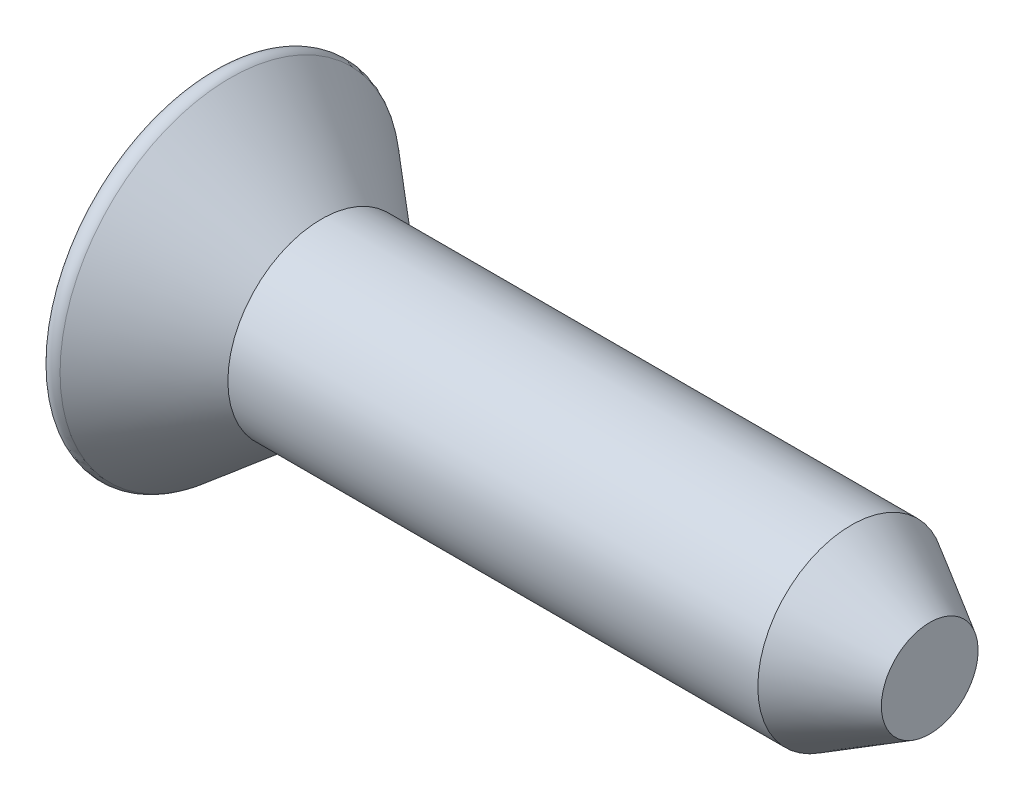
ISO-10303-21;
HEADER;
FILE_DESCRIPTION(('STEP AP214'),'2;1');
FILE_NAME('part.step','',(''),(''),'','','');
FILE_SCHEMA(('AUTOMOTIVE_DESIGN { 1 0 10303 214 1 1 1 1 }'));
ENDSEC;
DATA;
#1=APPLICATION_CONTEXT('core data for automotive mechanical design processes');
#2=APPLICATION_PROTOCOL_DEFINITION('international standard','automotive_design',2000,#1);
#3=PRODUCT_CONTEXT('',#1,'mechanical');
#4=PRODUCT('Part','Part','',(#3));
#5=PRODUCT_RELATED_PRODUCT_CATEGORY('part','',(#4));
#6=PRODUCT_DEFINITION_FORMATION('','',#4);
#7=PRODUCT_DEFINITION_CONTEXT('part definition',#1,'design');
#8=PRODUCT_DEFINITION('design','',#6,#7);
#9=PRODUCT_DEFINITION_SHAPE('','',#8);
#10=(LENGTH_UNIT() NAMED_UNIT(*) SI_UNIT(.MILLI.,.METRE.));
#11=(NAMED_UNIT(*) PLANE_ANGLE_UNIT() SI_UNIT($,.RADIAN.));
#12=(NAMED_UNIT(*) SI_UNIT($,.STERADIAN.) SOLID_ANGLE_UNIT());
#13=UNCERTAINTY_MEASURE_WITH_UNIT(LENGTH_MEASURE(1.E-05),#10,'distance_accuracy_value','');
#14=(GEOMETRIC_REPRESENTATION_CONTEXT(3) GLOBAL_UNCERTAINTY_ASSIGNED_CONTEXT((#13)) GLOBAL_UNIT_ASSIGNED_CONTEXT((#10,
#11,#12)) REPRESENTATION_CONTEXT('',''));
#15=CARTESIAN_POINT('',(0.,0.,0.));
#16=DIRECTION('',(0.,0.,1.));
#17=DIRECTION('',(1.,0.,0.));
#18=AXIS2_PLACEMENT_3D('',#15,#16,#17);
#19=CARTESIAN_POINT('',(0.,0.,0.));
#20=DIRECTION('',(-1.,0.,0.));
#21=DIRECTION('',(0.,0.,1.));
#22=AXIS2_PLACEMENT_3D('',#19,#20,#21);
#23=CYLINDRICAL_SURFACE('',#22,0.762);
#24=CARTESIAN_POINT('',(0.889,0.,0.));
#25=DIRECTION('',(-1.,0.,0.));
#26=DIRECTION('',(0.,0.,1.));
#27=AXIS2_PLACEMENT_3D('',#24,#25,#26);
#28=CIRCLE('',#27,0.762);
#29=CARTESIAN_POINT('',(0.889,0.,0.762));
#30=VERTEX_POINT('',#29);
#31=EDGE_CURVE('E234',#30,#30,#28,.T.);
#32=ORIENTED_EDGE('',*,*,#31,.F.);
#33=EDGE_LOOP('',(#32));
#34=FACE_BOUND('',#33,.T.);
#35=CARTESIAN_POINT('',(5.20408568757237,0.,0.));
#36=DIRECTION('',(-1.,0.,0.));
#37=DIRECTION('',(0.,0.,1.));
#38=AXIS2_PLACEMENT_3D('',#35,#36,#37);
#39=CIRCLE('',#38,0.762);
#40=CARTESIAN_POINT('',(5.20408568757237,0.,0.762));
#41=VERTEX_POINT('',#40);
#42=EDGE_CURVE('E453',#41,#41,#39,.T.);
#43=ORIENTED_EDGE('',*,*,#42,.T.);
#44=EDGE_LOOP('',(#43));
#45=FACE_BOUND('',#44,.T.);
#46=ADVANCED_FACE('F76',(#34,#45),#23,.T.);
#47=CARTESIAN_POINT('',(0.889,0.,0.));
#48=DIRECTION('',(-1.,0.,0.));
#49=DIRECTION('',(0.,0.,1.));
#50=AXIS2_PLACEMENT_3D('',#47,#48,#49);
#51=CONICAL_SURFACE('',#50,0.762,0.698131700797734);
#52=ORIENTED_EDGE('',*,*,#31,.T.);
#53=EDGE_LOOP('',(#52));
#54=FACE_BOUND('',#53,.T.);
#55=CARTESIAN_POINT('',(0.146043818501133,0.,0.));
#56=DIRECTION('',(-1.,0.,0.));
#57=DIRECTION('',(0.,0.,1.));
#58=AXIS2_PLACEMENT_3D('',#55,#56,#57);
#59=CIRCLE('',#58,1.38541425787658);
#60=CARTESIAN_POINT('',(0.146043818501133,0.,1.38541425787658));
#61=VERTEX_POINT('',#60);
#62=EDGE_CURVE('E237',#61,#61,#59,.T.);
#63=ORIENTED_EDGE('',*,*,#62,.F.);
#64=EDGE_LOOP('',(#63));
#65=FACE_BOUND('',#64,.T.);
#66=ADVANCED_FACE('F379',(#54,#65),#51,.T.);
#67=CARTESIAN_POINT('',(0.,0.1778,-0.7874));
#68=DIRECTION('',(-0.342020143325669,0.,0.939692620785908));
#69=DIRECTION('',(0.939692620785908,0.,0.342020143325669));
#70=AXIS2_PLACEMENT_3D('',#67,#68,#69);
#71=PLANE('',#70);
#72=DIRECTION('',(-0.939692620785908,0.,-0.342020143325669));
#73=VECTOR('',#72,1.);
#74=CARTESIAN_POINT('',(0.,-0.1778,-0.7874));
#75=LINE('',#74,#73);
#76=CARTESIAN_POINT('',(0.889,-0.1778,-0.463830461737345));
#77=VERTEX_POINT('',#76);
#78=CARTESIAN_POINT('',(0.,-0.1778,-0.7874));
#79=VERTEX_POINT('',#78);
#80=EDGE_CURVE('E244',#77,#79,#75,.T.);
#81=ORIENTED_EDGE('',*,*,#80,.F.);
#82=DIRECTION('',(0.,1.,0.));
#83=VECTOR('',#82,1.);
#84=CARTESIAN_POINT('',(0.889,0.1778,-0.463830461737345));
#85=LINE('',#84,#83);
#86=CARTESIAN_POINT('',(0.889,0.1778,-0.463830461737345));
#87=VERTEX_POINT('',#86);
#88=EDGE_CURVE('E49',#77,#87,#85,.T.);
#89=ORIENTED_EDGE('',*,*,#88,.T.);
#90=DIRECTION('',(-0.939692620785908,0.,-0.342020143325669));
#91=VECTOR('',#90,1.);
#92=CARTESIAN_POINT('',(0.785006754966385,0.1778,-0.501680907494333));
#93=LINE('',#92,#91);
#94=CARTESIAN_POINT('',(0.,0.1778,-0.7874));
#95=VERTEX_POINT('',#94);
#96=EDGE_CURVE('E248',#87,#95,#93,.T.);
#97=ORIENTED_EDGE('',*,*,#96,.T.);
#98=DIRECTION('',(0.,1.,0.));
#99=VECTOR('',#98,1.);
#100=CARTESIAN_POINT('',(0.,0.1778,-0.7874));
#101=LINE('',#100,#99);
#102=EDGE_CURVE('E227',#79,#95,#101,.T.);
#103=ORIENTED_EDGE('',*,*,#102,.F.);
#104=EDGE_LOOP('',(#81,#89,#97,#103));
#105=FACE_BOUND('',#104,.T.);
#106=ADVANCED_FACE('F356',(#105),#71,.T.);
#107=CARTESIAN_POINT('',(0.889,0.1778,-0.1778));
#108=DIRECTION('',(-1.,0.,0.));
#109=DIRECTION('',(0.,0.,1.));
#110=AXIS2_PLACEMENT_3D('',#107,#108,#109);
#111=PLANE('',#110);
#112=DIRECTION('',(0.,-0.707106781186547,-0.707106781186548));
#113=VECTOR('',#112,1.);
#114=CARTESIAN_POINT('',(0.889,-0.33528,0.1778));
#115=LINE('',#114,#113);
#116=CARTESIAN_POINT('',(0.889,-0.1778,0.33528));
#117=VERTEX_POINT('',#116);
#118=CARTESIAN_POINT('',(0.889,-0.33528,0.1778));
#119=VERTEX_POINT('',#118);
#120=EDGE_CURVE('E195',#117,#119,#115,.T.);
#121=ORIENTED_EDGE('',*,*,#120,.F.);
#122=DIRECTION('',(0.,0.,-1.));
#123=VECTOR('',#122,1.);
#124=CARTESIAN_POINT('',(0.889,-0.1778,0.1778));
#125=LINE('',#124,#123);
#126=CARTESIAN_POINT('',(0.889,-0.1778,0.463830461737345));
#127=VERTEX_POINT('',#126);
#128=EDGE_CURVE('E309',#127,#117,#125,.T.);
#129=ORIENTED_EDGE('',*,*,#128,.F.);
#130=DIRECTION('',(0.,-1.,0.));
#131=VECTOR('',#130,1.);
#132=CARTESIAN_POINT('',(0.889,0.1778,0.463830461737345));
#133=LINE('',#132,#131);
#134=CARTESIAN_POINT('',(0.889,0.1778,0.463830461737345));
#135=VERTEX_POINT('',#134);
#136=EDGE_CURVE('E263',#135,#127,#133,.T.);
#137=ORIENTED_EDGE('',*,*,#136,.F.);
#138=DIRECTION('',(0.,0.,1.));
#139=VECTOR('',#138,1.);
#140=CARTESIAN_POINT('',(0.889,0.1778,0.1778));
#141=LINE('',#140,#139);
#142=CARTESIAN_POINT('',(0.889,0.1778,0.33528));
#143=VERTEX_POINT('',#142);
#144=EDGE_CURVE('E280',#143,#135,#141,.T.);
#145=ORIENTED_EDGE('',*,*,#144,.F.);
#146=DIRECTION('',(0.,-0.707106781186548,0.707106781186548));
#147=VECTOR('',#146,1.);
#148=CARTESIAN_POINT('',(0.889,0.33528,0.1778));
#149=LINE('',#148,#147);
#150=CARTESIAN_POINT('',(0.889,0.33528,0.1778));
#151=VERTEX_POINT('',#150);
#152=EDGE_CURVE('E276',#151,#143,#149,.T.);
#153=ORIENTED_EDGE('',*,*,#152,.F.);
#154=DIRECTION('',(0.,-1.,0.));
#155=VECTOR('',#154,1.);
#156=CARTESIAN_POINT('',(0.889,0.7874,0.1778));
#157=LINE('',#156,#155);
#158=CARTESIAN_POINT('',(0.889,0.463830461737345,0.1778));
#159=VERTEX_POINT('',#158);
#160=EDGE_CURVE('E273',#159,#151,#157,.T.);
#161=ORIENTED_EDGE('',*,*,#160,.F.);
#162=DIRECTION('',(0.,0.,1.));
#163=VECTOR('',#162,1.);
#164=CARTESIAN_POINT('',(0.889,0.463830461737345,-0.1778));
#165=LINE('',#164,#163);
#166=CARTESIAN_POINT('',(0.889,0.463830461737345,-0.1778));
#167=VERTEX_POINT('',#166);
#168=EDGE_CURVE('E84',#167,#159,#165,.T.);
#169=ORIENTED_EDGE('',*,*,#168,.F.);
#170=DIRECTION('',(0.,1.,0.));
#171=VECTOR('',#170,1.);
#172=CARTESIAN_POINT('',(0.889,0.7874,-0.1778));
#173=LINE('',#172,#171);
#174=CARTESIAN_POINT('',(0.889,0.33528,-0.1778));
#175=VERTEX_POINT('',#174);
#176=EDGE_CURVE('E233',#175,#167,#173,.T.);
#177=ORIENTED_EDGE('',*,*,#176,.F.);
#178=DIRECTION('',(0.,0.707106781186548,0.707106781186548));
#179=VECTOR('',#178,1.);
#180=CARTESIAN_POINT('',(0.889,0.33528,-0.1778));
#181=LINE('',#180,#179);
#182=CARTESIAN_POINT('',(0.889,0.1778,-0.33528));
#183=VERTEX_POINT('',#182);
#184=EDGE_CURVE('E91',#183,#175,#181,.T.);
#185=ORIENTED_EDGE('',*,*,#184,.F.);
#186=DIRECTION('',(0.,0.,1.));
#187=VECTOR('',#186,1.);
#188=CARTESIAN_POINT('',(0.889,0.1778,-0.7874));
#189=LINE('',#188,#187);
#190=EDGE_CURVE('E250',#87,#183,#189,.T.);
#191=ORIENTED_EDGE('',*,*,#190,.F.);
#192=ORIENTED_EDGE('',*,*,#88,.F.);
#193=DIRECTION('',(0.,0.,-1.));
#194=VECTOR('',#193,1.);
#195=CARTESIAN_POINT('',(0.889,-0.1778,-0.7874));
#196=LINE('',#195,#194);
#197=CARTESIAN_POINT('',(0.889,-0.1778,-0.33528));
#198=VERTEX_POINT('',#197);
#199=EDGE_CURVE('E345',#198,#77,#196,.T.);
#200=ORIENTED_EDGE('',*,*,#199,.F.);
#201=DIRECTION('',(0.,0.707106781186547,-0.707106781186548));
#202=VECTOR('',#201,1.);
#203=CARTESIAN_POINT('',(0.889,-0.33528,-0.1778));
#204=LINE('',#203,#202);
#205=CARTESIAN_POINT('',(0.889,-0.33528,-0.1778));
#206=VERTEX_POINT('',#205);
#207=EDGE_CURVE('E315',#206,#198,#204,.T.);
#208=ORIENTED_EDGE('',*,*,#207,.F.);
#209=DIRECTION('',(0.,1.,0.));
#210=VECTOR('',#209,1.);
#211=CARTESIAN_POINT('',(0.889,-0.1778,-0.1778));
#212=LINE('',#211,#210);
#213=CARTESIAN_POINT('',(0.889,-0.463830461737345,-0.1778));
#214=VERTEX_POINT('',#213);
#215=EDGE_CURVE('E342',#214,#206,#212,.T.);
#216=ORIENTED_EDGE('',*,*,#215,.F.);
#217=DIRECTION('',(0.,0.,-1.));
#218=VECTOR('',#217,1.);
#219=CARTESIAN_POINT('',(0.889,-0.463830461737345,-0.1778));
#220=LINE('',#219,#218);
#221=CARTESIAN_POINT('',(0.889,-0.463830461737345,0.1778));
#222=VERTEX_POINT('',#221);
#223=EDGE_CURVE('E99',#222,#214,#220,.T.);
#224=ORIENTED_EDGE('',*,*,#223,.F.);
#225=DIRECTION('',(0.,-1.,0.));
#226=VECTOR('',#225,1.);
#227=CARTESIAN_POINT('',(0.889,-0.1778,0.1778));
#228=LINE('',#227,#226);
#229=EDGE_CURVE('E340',#119,#222,#228,.T.);
#230=ORIENTED_EDGE('',*,*,#229,.F.);
#231=EDGE_LOOP('',(#121,#129,#137,#145,#153,#161,#169,#177,#185,#191,#192,#200,#208,#216,#224,#230));
#232=FACE_BOUND('',#231,.T.);
#233=ADVANCED_FACE('F274',(#232),#111,.T.);
#234=CARTESIAN_POINT('',(0.,0.7874,-0.1778));
#235=DIRECTION('',(-0.342020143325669,-0.939692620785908,0.));
#236=DIRECTION('',(0.939692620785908,-0.342020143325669,0.));
#237=AXIS2_PLACEMENT_3D('',#234,#235,#236);
#238=PLANE('',#237);
#239=DIRECTION('',(-0.939692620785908,0.342020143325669,0.));
#240=VECTOR('',#239,1.);
#241=CARTESIAN_POINT('',(0.,0.7874,-0.1778));
#242=LINE('',#241,#240);
#243=CARTESIAN_POINT('',(0.,0.7874,-0.1778));
#244=VERTEX_POINT('',#243);
#245=EDGE_CURVE('E238',#167,#244,#242,.T.);
#246=ORIENTED_EDGE('',*,*,#245,.F.);
#247=ORIENTED_EDGE('',*,*,#168,.T.);
#248=DIRECTION('',(-0.939692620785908,0.342020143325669,0.));
#249=VECTOR('',#248,1.);
#250=CARTESIAN_POINT('',(0.785006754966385,0.501680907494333,0.1778));
#251=LINE('',#250,#249);
#252=CARTESIAN_POINT('',(0.,0.7874,0.1778));
#253=VERTEX_POINT('',#252);
#254=EDGE_CURVE('E253',#159,#253,#251,.T.);
#255=ORIENTED_EDGE('',*,*,#254,.T.);
#256=DIRECTION('',(0.,0.,1.));
#257=VECTOR('',#256,1.);
#258=CARTESIAN_POINT('',(0.,0.7874,-0.1778));
#259=LINE('',#258,#257);
#260=EDGE_CURVE('E289',#244,#253,#259,.T.);
#261=ORIENTED_EDGE('',*,*,#260,.F.);
#262=EDGE_LOOP('',(#246,#247,#255,#261));
#263=FACE_BOUND('',#262,.T.);
#264=ADVANCED_FACE('F268',(#263),#238,.T.);
#265=CARTESIAN_POINT('',(0.,0.1778,0.7874));
#266=DIRECTION('',(-0.342020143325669,0.,-0.939692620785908));
#267=DIRECTION('',(-0.939692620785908,0.,0.342020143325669));
#268=AXIS2_PLACEMENT_3D('',#265,#266,#267);
#269=PLANE('',#268);
#270=DIRECTION('',(-0.939692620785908,0.,0.342020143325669));
#271=VECTOR('',#270,1.);
#272=CARTESIAN_POINT('',(0.,0.1778,0.7874));
#273=LINE('',#272,#271);
#274=CARTESIAN_POINT('',(0.,0.1778,0.7874));
#275=VERTEX_POINT('',#274);
#276=EDGE_CURVE('E255',#135,#275,#273,.T.);
#277=ORIENTED_EDGE('',*,*,#276,.F.);
#278=ORIENTED_EDGE('',*,*,#136,.T.);
#279=DIRECTION('',(-0.939692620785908,0.,0.342020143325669));
#280=VECTOR('',#279,1.);
#281=CARTESIAN_POINT('',(0.980928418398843,-0.1778,0.430371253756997));
#282=LINE('',#281,#280);
#283=CARTESIAN_POINT('',(0.,-0.1778,0.7874));
#284=VERTEX_POINT('',#283);
#285=EDGE_CURVE('E258',#127,#284,#282,.T.);
#286=ORIENTED_EDGE('',*,*,#285,.T.);
#287=DIRECTION('',(0.,-1.,0.));
#288=VECTOR('',#287,1.);
#289=CARTESIAN_POINT('',(0.,0.1778,0.7874));
#290=LINE('',#289,#288);
#291=EDGE_CURVE('E219',#275,#284,#290,.T.);
#292=ORIENTED_EDGE('',*,*,#291,.F.);
#293=EDGE_LOOP('',(#277,#278,#286,#292));
#294=FACE_BOUND('',#293,.T.);
#295=ADVANCED_FACE('F302',(#294),#269,.T.);
#296=CARTESIAN_POINT('',(0.,-0.7874,-0.1778));
#297=DIRECTION('',(-0.342020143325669,0.939692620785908,0.));
#298=DIRECTION('',(-0.939692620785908,-0.342020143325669,0.));
#299=AXIS2_PLACEMENT_3D('',#296,#297,#298);
#300=PLANE('',#299);
#301=DIRECTION('',(-0.939692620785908,-0.342020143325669,0.));
#302=VECTOR('',#301,1.);
#303=CARTESIAN_POINT('',(0.,-0.7874,0.1778));
#304=LINE('',#303,#302);
#305=CARTESIAN_POINT('',(0.,-0.7874,0.1778));
#306=VERTEX_POINT('',#305);
#307=EDGE_CURVE('E213',#222,#306,#304,.T.);
#308=ORIENTED_EDGE('',*,*,#307,.F.);
#309=ORIENTED_EDGE('',*,*,#223,.T.);
#310=DIRECTION('',(-0.939692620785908,-0.342020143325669,0.));
#311=VECTOR('',#310,1.);
#312=CARTESIAN_POINT('',(0.980928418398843,-0.430371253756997,-0.1778));
#313=LINE('',#312,#311);
#314=CARTESIAN_POINT('',(0.,-0.7874,-0.1778));
#315=VERTEX_POINT('',#314);
#316=EDGE_CURVE('E247',#214,#315,#313,.T.);
#317=ORIENTED_EDGE('',*,*,#316,.T.);
#318=DIRECTION('',(0.,0.,-1.));
#319=VECTOR('',#318,1.);
#320=CARTESIAN_POINT('',(0.,-0.7874,-0.1778));
#321=LINE('',#320,#319);
#322=EDGE_CURVE('E215',#306,#315,#321,.T.);
#323=ORIENTED_EDGE('',*,*,#322,.F.);
#324=EDGE_LOOP('',(#308,#309,#317,#323));
#325=FACE_BOUND('',#324,.T.);
#326=ADVANCED_FACE('F78',(#325),#300,.T.);
#327=CARTESIAN_POINT('',(0.,0.,0.));
#328=DIRECTION('',(1.,0.,0.));
#329=DIRECTION('',(0.,0.,-1.));
#330=AXIS2_PLACEMENT_3D('',#327,#328,#329);
#331=PLANE('',#330);
#332=CARTESIAN_POINT('',(0.,0.,0.));
#333=DIRECTION('',(-1.,0.,0.));
#334=DIRECTION('',(0.,0.,1.));
#335=AXIS2_PLACEMENT_3D('',#332,#333,#334);
#336=CIRCLE('',#335,1.3173129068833);
#337=CARTESIAN_POINT('',(0.,0.,1.3173129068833));
#338=VERTEX_POINT('',#337);
#339=EDGE_CURVE('E241',#338,#338,#336,.T.);
#340=ORIENTED_EDGE('',*,*,#339,.T.);
#341=EDGE_LOOP('',(#340));
#342=FACE_BOUND('',#341,.T.);
#343=DIRECTION('',(0.,0.,-1.));
#344=VECTOR('',#343,1.);
#345=CARTESIAN_POINT('',(0.,-0.1778,0.1778));
#346=LINE('',#345,#344);
#347=CARTESIAN_POINT('',(0.,-0.1778,0.33528));
#348=VERTEX_POINT('',#347);
#349=EDGE_CURVE('E209',#284,#348,#346,.T.);
#350=ORIENTED_EDGE('',*,*,#349,.T.);
#351=DIRECTION('',(0.,0.707106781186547,0.707106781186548));
#352=VECTOR('',#351,1.);
#353=CARTESIAN_POINT('',(0.,-0.33528,0.1778));
#354=LINE('',#353,#352);
#355=CARTESIAN_POINT('',(0.,-0.33528,0.1778));
#356=VERTEX_POINT('',#355);
#357=EDGE_CURVE('E192',#356,#348,#354,.T.);
#358=ORIENTED_EDGE('',*,*,#357,.F.);
#359=DIRECTION('',(0.,-1.,0.));
#360=VECTOR('',#359,1.);
#361=CARTESIAN_POINT('',(0.,-0.1778,0.1778));
#362=LINE('',#361,#360);
#363=EDGE_CURVE('E205',#356,#306,#362,.T.);
#364=ORIENTED_EDGE('',*,*,#363,.T.);
#365=ORIENTED_EDGE('',*,*,#322,.T.);
#366=DIRECTION('',(0.,1.,0.));
#367=VECTOR('',#366,1.);
#368=CARTESIAN_POINT('',(0.,-0.1778,-0.1778));
#369=LINE('',#368,#367);
#370=CARTESIAN_POINT('',(0.,-0.33528,-0.1778));
#371=VERTEX_POINT('',#370);
#372=EDGE_CURVE('E217',#315,#371,#369,.T.);
#373=ORIENTED_EDGE('',*,*,#372,.T.);
#374=DIRECTION('',(0.,-0.707106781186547,0.707106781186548));
#375=VECTOR('',#374,1.);
#376=CARTESIAN_POINT('',(0.,-0.33528,-0.1778));
#377=LINE('',#376,#375);
#378=CARTESIAN_POINT('',(0.,-0.1778,-0.33528));
#379=VERTEX_POINT('',#378);
#380=EDGE_CURVE('E311',#379,#371,#377,.T.);
#381=ORIENTED_EDGE('',*,*,#380,.F.);
#382=DIRECTION('',(0.,0.,-1.));
#383=VECTOR('',#382,1.);
#384=CARTESIAN_POINT('',(0.,-0.1778,-0.7874));
#385=LINE('',#384,#383);
#386=EDGE_CURVE('E225',#379,#79,#385,.T.);
#387=ORIENTED_EDGE('',*,*,#386,.T.);
#388=ORIENTED_EDGE('',*,*,#102,.T.);
#389=DIRECTION('',(0.,0.,1.));
#390=VECTOR('',#389,1.);
#391=CARTESIAN_POINT('',(0.,0.1778,-0.7874));
#392=LINE('',#391,#390);
#393=CARTESIAN_POINT('',(0.,0.1778,-0.33528));
#394=VERTEX_POINT('',#393);
#395=EDGE_CURVE('E230',#95,#394,#392,.T.);
#396=ORIENTED_EDGE('',*,*,#395,.T.);
#397=DIRECTION('',(0.,-0.707106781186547,-0.707106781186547));
#398=VECTOR('',#397,1.);
#399=CARTESIAN_POINT('',(0.,0.33528,-0.1778));
#400=LINE('',#399,#398);
#401=CARTESIAN_POINT('',(0.,0.33528,-0.1778));
#402=VERTEX_POINT('',#401);
#403=EDGE_CURVE('E317',#402,#394,#400,.T.);
#404=ORIENTED_EDGE('',*,*,#403,.F.);
#405=DIRECTION('',(0.,1.,0.));
#406=VECTOR('',#405,1.);
#407=CARTESIAN_POINT('',(0.,0.7874,-0.1778));
#408=LINE('',#407,#406);
#409=EDGE_CURVE('E293',#402,#244,#408,.T.);
#410=ORIENTED_EDGE('',*,*,#409,.T.);
#411=ORIENTED_EDGE('',*,*,#260,.T.);
#412=DIRECTION('',(0.,-1.,0.));
#413=VECTOR('',#412,1.);
#414=CARTESIAN_POINT('',(0.,0.7874,0.1778));
#415=LINE('',#414,#413);
#416=CARTESIAN_POINT('',(0.,0.33528,0.1778));
#417=VERTEX_POINT('',#416);
#418=EDGE_CURVE('E284',#253,#417,#415,.T.);
#419=ORIENTED_EDGE('',*,*,#418,.T.);
#420=DIRECTION('',(0.,0.707106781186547,-0.707106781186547));
#421=VECTOR('',#420,1.);
#422=CARTESIAN_POINT('',(0.,0.33528,0.1778));
#423=LINE('',#422,#421);
#424=CARTESIAN_POINT('',(0.,0.1778,0.33528));
#425=VERTEX_POINT('',#424);
#426=EDGE_CURVE('E331',#425,#417,#423,.T.);
#427=ORIENTED_EDGE('',*,*,#426,.F.);
#428=DIRECTION('',(0.,0.,1.));
#429=VECTOR('',#428,1.);
#430=CARTESIAN_POINT('',(0.,0.1778,0.1778));
#431=LINE('',#430,#429);
#432=EDGE_CURVE('E288',#425,#275,#431,.T.);
#433=ORIENTED_EDGE('',*,*,#432,.T.);
#434=ORIENTED_EDGE('',*,*,#291,.T.);
#435=EDGE_LOOP('',(#350,#358,#364,#365,#373,#381,#387,#388,#396,#404,#410,#411,#419,#427,#433,#434));
#436=FACE_BOUND('',#435,.T.);
#437=ADVANCED_FACE('F203',(#342,#436),#331,.F.);
#438=CARTESIAN_POINT('',(0.0889,0.,0.));
#439=DIRECTION('',(-1.,0.,0.));
#440=DIRECTION('',(0.,0.,1.));
#441=AXIS2_PLACEMENT_3D('',#438,#439,#440);
#442=TOROIDAL_SURFACE('',#441,1.3173129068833,0.0889000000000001);
#443=ORIENTED_EDGE('',*,*,#339,.F.);
#444=EDGE_LOOP('',(#443));
#445=FACE_BOUND('',#444,.T.);
#446=ORIENTED_EDGE('',*,*,#62,.T.);
#447=EDGE_LOOP('',(#446));
#448=FACE_BOUND('',#447,.T.);
#449=ADVANCED_FACE('F375',(#445,#448),#442,.T.);
#450=CARTESIAN_POINT('',(0.889,0.7874,-0.1778));
#451=DIRECTION('',(0.,0.,1.));
#452=DIRECTION('',(0.,-1.,0.));
#453=AXIS2_PLACEMENT_3D('',#450,#451,#452);
#454=PLANE('',#453);
#455=DIRECTION('',(-1.,0.,0.));
#456=VECTOR('',#455,1.);
#457=CARTESIAN_POINT('',(1.11171035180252,0.33528,-0.1778));
#458=LINE('',#457,#456);
#459=EDGE_CURVE('E325',#175,#402,#458,.T.);
#460=ORIENTED_EDGE('',*,*,#459,.F.);
#461=ORIENTED_EDGE('',*,*,#176,.T.);
#462=ORIENTED_EDGE('',*,*,#245,.T.);
#463=ORIENTED_EDGE('',*,*,#409,.F.);
#464=EDGE_LOOP('',(#460,#461,#462,#463));
#465=FACE_BOUND('',#464,.T.);
#466=ADVANCED_FACE('F396',(#465),#454,.T.);
#467=CARTESIAN_POINT('',(0.889,0.7874,0.1778));
#468=DIRECTION('',(0.,0.,-1.));
#469=DIRECTION('',(-1.,0.,0.));
#470=AXIS2_PLACEMENT_3D('',#467,#468,#469);
#471=PLANE('',#470);
#472=DIRECTION('',(-1.,0.,0.));
#473=VECTOR('',#472,1.);
#474=CARTESIAN_POINT('',(1.11171035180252,0.33528,0.1778));
#475=LINE('',#474,#473);
#476=EDGE_CURVE('E286',#151,#417,#475,.T.);
#477=ORIENTED_EDGE('',*,*,#476,.T.);
#478=ORIENTED_EDGE('',*,*,#418,.F.);
#479=ORIENTED_EDGE('',*,*,#254,.F.);
#480=ORIENTED_EDGE('',*,*,#160,.T.);
#481=EDGE_LOOP('',(#477,#478,#479,#480));
#482=FACE_BOUND('',#481,.T.);
#483=ADVANCED_FACE('F282',(#482),#471,.T.);
#484=CARTESIAN_POINT('',(0.889,0.1778,0.1778));
#485=DIRECTION('',(0.,-1.,0.));
#486=DIRECTION('',(0.,0.,-1.));
#487=AXIS2_PLACEMENT_3D('',#484,#485,#486);
#488=PLANE('',#487);
#489=DIRECTION('',(-1.,0.,0.));
#490=VECTOR('',#489,1.);
#491=CARTESIAN_POINT('',(1.11171035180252,0.1778,0.33528));
#492=LINE('',#491,#490);
#493=EDGE_CURVE('E334',#143,#425,#492,.T.);
#494=ORIENTED_EDGE('',*,*,#493,.F.);
#495=ORIENTED_EDGE('',*,*,#144,.T.);
#496=ORIENTED_EDGE('',*,*,#276,.T.);
#497=ORIENTED_EDGE('',*,*,#432,.F.);
#498=EDGE_LOOP('',(#494,#495,#496,#497));
#499=FACE_BOUND('',#498,.T.);
#500=ADVANCED_FACE('F421',(#499),#488,.T.);
#501=CARTESIAN_POINT('',(0.889,-0.1778,0.1778));
#502=DIRECTION('',(0.,1.,0.));
#503=DIRECTION('',(0.,0.,1.));
#504=AXIS2_PLACEMENT_3D('',#501,#502,#503);
#505=PLANE('',#504);
#506=DIRECTION('',(-1.,0.,0.));
#507=VECTOR('',#506,1.);
#508=CARTESIAN_POINT('',(1.11171035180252,-0.1778,0.33528));
#509=LINE('',#508,#507);
#510=EDGE_CURVE('E199',#117,#348,#509,.T.);
#511=ORIENTED_EDGE('',*,*,#510,.T.);
#512=ORIENTED_EDGE('',*,*,#349,.F.);
#513=ORIENTED_EDGE('',*,*,#285,.F.);
#514=ORIENTED_EDGE('',*,*,#128,.T.);
#515=EDGE_LOOP('',(#511,#512,#513,#514));
#516=FACE_BOUND('',#515,.T.);
#517=ADVANCED_FACE('F308',(#516),#505,.T.);
#518=CARTESIAN_POINT('',(0.889,-0.1778,0.1778));
#519=DIRECTION('',(0.,0.,-1.));
#520=DIRECTION('',(0.,1.,0.));
#521=AXIS2_PLACEMENT_3D('',#518,#519,#520);
#522=PLANE('',#521);
#523=DIRECTION('',(-1.,0.,0.));
#524=VECTOR('',#523,1.);
#525=CARTESIAN_POINT('',(1.11171035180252,-0.33528,0.1778));
#526=LINE('',#525,#524);
#527=EDGE_CURVE('E189',#119,#356,#526,.T.);
#528=ORIENTED_EDGE('',*,*,#527,.F.);
#529=ORIENTED_EDGE('',*,*,#229,.T.);
#530=ORIENTED_EDGE('',*,*,#307,.T.);
#531=ORIENTED_EDGE('',*,*,#363,.F.);
#532=EDGE_LOOP('',(#528,#529,#530,#531));
#533=FACE_BOUND('',#532,.T.);
#534=ADVANCED_FACE('F212',(#533),#522,.T.);
#535=CARTESIAN_POINT('',(0.889,-0.1778,-0.1778));
#536=DIRECTION('',(0.,0.,1.));
#537=DIRECTION('',(0.,-1.,0.));
#538=AXIS2_PLACEMENT_3D('',#535,#536,#537);
#539=PLANE('',#538);
#540=DIRECTION('',(-1.,0.,0.));
#541=VECTOR('',#540,1.);
#542=CARTESIAN_POINT('',(1.11171035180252,-0.33528,-0.1778));
#543=LINE('',#542,#541);
#544=EDGE_CURVE('E318',#206,#371,#543,.T.);
#545=ORIENTED_EDGE('',*,*,#544,.T.);
#546=ORIENTED_EDGE('',*,*,#372,.F.);
#547=ORIENTED_EDGE('',*,*,#316,.F.);
#548=ORIENTED_EDGE('',*,*,#215,.T.);
#549=EDGE_LOOP('',(#545,#546,#547,#548));
#550=FACE_BOUND('',#549,.T.);
#551=ADVANCED_FACE('F368',(#550),#539,.T.);
#552=CARTESIAN_POINT('',(0.889,-0.1778,-0.7874));
#553=DIRECTION('',(0.,1.,0.));
#554=DIRECTION('',(0.,0.,1.));
#555=AXIS2_PLACEMENT_3D('',#552,#553,#554);
#556=PLANE('',#555);
#557=DIRECTION('',(-1.,0.,0.));
#558=VECTOR('',#557,1.);
#559=CARTESIAN_POINT('',(1.11171035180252,-0.1778,-0.33528));
#560=LINE('',#559,#558);
#561=EDGE_CURVE('E320',#198,#379,#560,.T.);
#562=ORIENTED_EDGE('',*,*,#561,.F.);
#563=ORIENTED_EDGE('',*,*,#199,.T.);
#564=ORIENTED_EDGE('',*,*,#80,.T.);
#565=ORIENTED_EDGE('',*,*,#386,.F.);
#566=EDGE_LOOP('',(#562,#563,#564,#565));
#567=FACE_BOUND('',#566,.T.);
#568=ADVANCED_FACE('F360',(#567),#556,.T.);
#569=CARTESIAN_POINT('',(0.889,0.1778,-0.7874));
#570=DIRECTION('',(0.,-1.,0.));
#571=DIRECTION('',(0.,0.,-1.));
#572=AXIS2_PLACEMENT_3D('',#569,#570,#571);
#573=PLANE('',#572);
#574=DIRECTION('',(-1.,0.,0.));
#575=VECTOR('',#574,1.);
#576=CARTESIAN_POINT('',(1.11171035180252,0.1778,-0.33528));
#577=LINE('',#576,#575);
#578=EDGE_CURVE('E326',#183,#394,#577,.T.);
#579=ORIENTED_EDGE('',*,*,#578,.T.);
#580=ORIENTED_EDGE('',*,*,#395,.F.);
#581=ORIENTED_EDGE('',*,*,#96,.F.);
#582=ORIENTED_EDGE('',*,*,#190,.T.);
#583=EDGE_LOOP('',(#579,#580,#581,#582));
#584=FACE_BOUND('',#583,.T.);
#585=ADVANCED_FACE('F349',(#584),#573,.T.);
#586=CARTESIAN_POINT('',(1.11171035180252,0.33528,0.1778));
#587=DIRECTION('',(0.,0.707106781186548,0.707106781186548));
#588=DIRECTION('',(0.,-0.707106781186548,0.707106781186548));
#589=AXIS2_PLACEMENT_3D('',#586,#587,#588);
#590=PLANE('',#589);
#591=ORIENTED_EDGE('',*,*,#152,.T.);
#592=ORIENTED_EDGE('',*,*,#493,.T.);
#593=ORIENTED_EDGE('',*,*,#426,.T.);
#594=ORIENTED_EDGE('',*,*,#476,.F.);
#595=EDGE_LOOP('',(#591,#592,#593,#594));
#596=FACE_BOUND('',#595,.T.);
#597=ADVANCED_FACE('F409',(#596),#590,.F.);
#598=CARTESIAN_POINT('',(1.11171035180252,0.33528,-0.1778));
#599=DIRECTION('',(0.,0.707106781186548,-0.707106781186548));
#600=DIRECTION('',(0.,0.707106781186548,0.707106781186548));
#601=AXIS2_PLACEMENT_3D('',#598,#599,#600);
#602=PLANE('',#601);
#603=ORIENTED_EDGE('',*,*,#184,.T.);
#604=ORIENTED_EDGE('',*,*,#459,.T.);
#605=ORIENTED_EDGE('',*,*,#403,.T.);
#606=ORIENTED_EDGE('',*,*,#578,.F.);
#607=EDGE_LOOP('',(#603,#604,#605,#606));
#608=FACE_BOUND('',#607,.T.);
#609=ADVANCED_FACE('F432',(#608),#602,.F.);
#610=CARTESIAN_POINT('',(1.11171035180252,-0.33528,-0.1778));
#611=DIRECTION('',(0.,-0.707106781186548,-0.707106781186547));
#612=DIRECTION('',(0.,0.707106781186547,-0.707106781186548));
#613=AXIS2_PLACEMENT_3D('',#610,#611,#612);
#614=PLANE('',#613);
#615=ORIENTED_EDGE('',*,*,#207,.T.);
#616=ORIENTED_EDGE('',*,*,#561,.T.);
#617=ORIENTED_EDGE('',*,*,#380,.T.);
#618=ORIENTED_EDGE('',*,*,#544,.F.);
#619=EDGE_LOOP('',(#615,#616,#617,#618));
#620=FACE_BOUND('',#619,.T.);
#621=ADVANCED_FACE('F363',(#620),#614,.F.);
#622=CARTESIAN_POINT('',(1.11171035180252,-0.33528,0.1778));
#623=DIRECTION('',(0.,-0.707106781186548,0.707106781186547));
#624=DIRECTION('',(0.,-0.707106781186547,-0.707106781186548));
#625=AXIS2_PLACEMENT_3D('',#622,#623,#624);
#626=PLANE('',#625);
#627=ORIENTED_EDGE('',*,*,#120,.T.);
#628=ORIENTED_EDGE('',*,*,#527,.T.);
#629=ORIENTED_EDGE('',*,*,#357,.T.);
#630=ORIENTED_EDGE('',*,*,#510,.F.);
#631=EDGE_LOOP('',(#627,#628,#629,#630));
#632=FACE_BOUND('',#631,.T.);
#633=ADVANCED_FACE('F191',(#632),#626,.F.);
#634=CARTESIAN_POINT('',(5.20408568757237,0.,0.));
#635=DIRECTION('',(-1.,0.,0.));
#636=DIRECTION('',(0.,0.,1.));
#637=AXIS2_PLACEMENT_3D('',#634,#635,#636);
#638=CONICAL_SURFACE('',#637,0.762,0.523598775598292);
#639=CARTESIAN_POINT('',(5.842,0.,0.));
#640=DIRECTION('',(-1.,0.,0.));
#641=DIRECTION('',(0.,0.,1.));
#642=AXIS2_PLACEMENT_3D('',#639,#640,#641);
#643=CIRCLE('',#642,0.3937);
#644=CARTESIAN_POINT('',(5.842,0.,0.3937));
#645=VERTEX_POINT('',#644);
#646=EDGE_CURVE('E210',#645,#645,#643,.T.);
#647=ORIENTED_EDGE('',*,*,#646,.T.);
#648=EDGE_LOOP('',(#647));
#649=FACE_BOUND('',#648,.T.);
#650=ORIENTED_EDGE('',*,*,#42,.F.);
#651=EDGE_LOOP('',(#650));
#652=FACE_BOUND('',#651,.T.);
#653=ADVANCED_FACE('F442',(#649,#652),#638,.T.);
#654=CARTESIAN_POINT('',(5.842,0.762,0.));
#655=DIRECTION('',(-1.,0.,0.));
#656=DIRECTION('',(0.,0.,1.));
#657=AXIS2_PLACEMENT_3D('',#654,#655,#656);
#658=PLANE('',#657);
#659=ORIENTED_EDGE('',*,*,#646,.F.);
#660=EDGE_LOOP('',(#659));
#661=FACE_BOUND('',#660,.T.);
#662=ADVANCED_FACE('F392',(#661),#658,.F.);
#663=CLOSED_SHELL('',(#46,#66,#106,#233,#264,#295,#326,#437,#449,#466,#483,#500,#517,#534,#551,
#568,#585,#597,#609,#621,#633,#653,#662));
#664=MANIFOLD_SOLID_BREP('B6',#663);
#665=ADVANCED_BREP_SHAPE_REPRESENTATION('',(#18,#664),#14);
#666=SHAPE_DEFINITION_REPRESENTATION(#9,#665);
ENDSEC;
END-ISO-10303-21;
